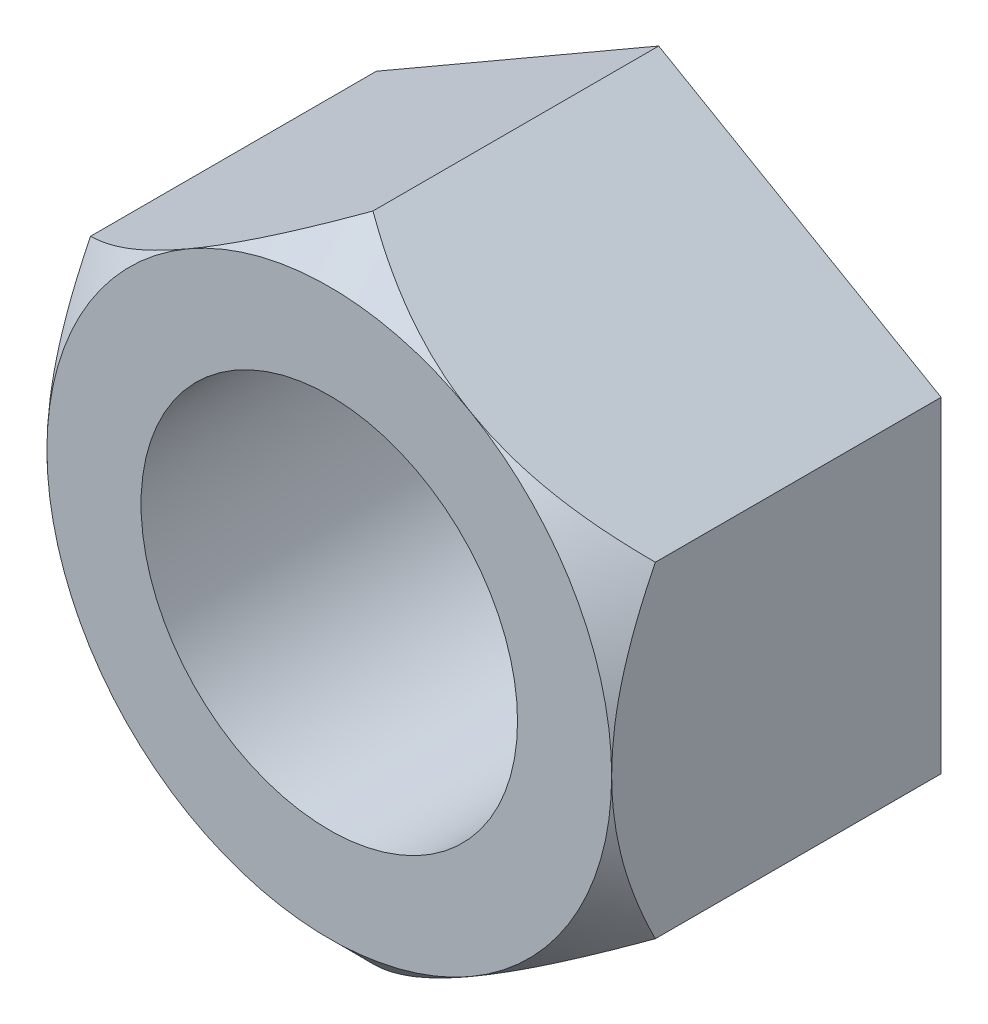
ISO-10303-21;
HEADER;
FILE_DESCRIPTION(('STEP AP214'),'2;1');
FILE_NAME('part.step','',(''),(''),'','','');
FILE_SCHEMA(('AUTOMOTIVE_DESIGN { 1 0 10303 214 1 1 1 1 }'));
ENDSEC;
DATA;
#1=APPLICATION_CONTEXT('core data for automotive mechanical design processes');
#2=APPLICATION_PROTOCOL_DEFINITION('international standard','automotive_design',2000,#1);
#3=PRODUCT_CONTEXT('',#1,'mechanical');
#4=PRODUCT('Part','Part','',(#3));
#5=PRODUCT_RELATED_PRODUCT_CATEGORY('part','',(#4));
#6=PRODUCT_DEFINITION_FORMATION('','',#4);
#7=PRODUCT_DEFINITION_CONTEXT('part definition',#1,'design');
#8=PRODUCT_DEFINITION('design','',#6,#7);
#9=PRODUCT_DEFINITION_SHAPE('','',#8);
#10=(LENGTH_UNIT() NAMED_UNIT(*) SI_UNIT(.MILLI.,.METRE.));
#11=(NAMED_UNIT(*) PLANE_ANGLE_UNIT() SI_UNIT($,.RADIAN.));
#12=(NAMED_UNIT(*) SI_UNIT($,.STERADIAN.) SOLID_ANGLE_UNIT());
#13=UNCERTAINTY_MEASURE_WITH_UNIT(LENGTH_MEASURE(1.E-05),#10,'distance_accuracy_value','');
#14=(GEOMETRIC_REPRESENTATION_CONTEXT(3) GLOBAL_UNCERTAINTY_ASSIGNED_CONTEXT((#13)) GLOBAL_UNIT_ASSIGNED_CONTEXT((#10,
#11,#12)) REPRESENTATION_CONTEXT('',''));
#15=CARTESIAN_POINT('',(0.,0.,0.));
#16=DIRECTION('',(0.,0.,1.));
#17=DIRECTION('',(1.,0.,0.));
#18=AXIS2_PLACEMENT_3D('',#15,#16,#17);
#19=CARTESIAN_POINT('',(0.,10.9985226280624,11.1125));
#20=DIRECTION('',(0.,0.,1.));
#21=DIRECTION('',(1.,0.,0.));
#22=AXIS2_PLACEMENT_3D('',#19,#20,#21);
#23=PLANE('',#22);
#24=CARTESIAN_POINT('',(0.,0.,11.1125));
#25=DIRECTION('',(0.,0.,1.));
#26=DIRECTION('',(1.,0.,0.));
#27=AXIS2_PLACEMENT_3D('',#24,#25,#26);
#28=CIRCLE('',#27,9.525);
#29=CARTESIAN_POINT('',(4.76250000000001,-8.24889197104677,11.1125));
#30=VERTEX_POINT('',#29);
#31=CARTESIAN_POINT('',(9.525,0.,11.1125));
#32=VERTEX_POINT('',#31);
#33=EDGE_CURVE('E136',#30,#32,#28,.T.);
#34=ORIENTED_EDGE('',*,*,#33,.T.);
#35=CARTESIAN_POINT('',(4.7625,8.24889197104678,11.1125));
#36=VERTEX_POINT('',#35);
#37=EDGE_CURVE('E119',#32,#36,#28,.T.);
#38=ORIENTED_EDGE('',*,*,#37,.T.);
#39=CARTESIAN_POINT('',(-4.7625,8.24889197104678,11.1125));
#40=VERTEX_POINT('',#39);
#41=EDGE_CURVE('E110',#36,#40,#28,.T.);
#42=ORIENTED_EDGE('',*,*,#41,.T.);
#43=CARTESIAN_POINT('',(-9.525,0.,11.1125));
#44=VERTEX_POINT('',#43);
#45=EDGE_CURVE('E120',#40,#44,#28,.T.);
#46=ORIENTED_EDGE('',*,*,#45,.T.);
#47=CARTESIAN_POINT('',(-4.76249999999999,-8.24889197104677,11.1125));
#48=VERTEX_POINT('',#47);
#49=EDGE_CURVE('E53',#44,#48,#28,.T.);
#50=ORIENTED_EDGE('',*,*,#49,.T.);
#51=EDGE_CURVE('E61',#48,#30,#28,.T.);
#52=ORIENTED_EDGE('',*,*,#51,.T.);
#53=EDGE_LOOP('',(#34,#38,#42,#46,#50,#52));
#54=FACE_BOUND('',#53,.T.);
#55=CARTESIAN_POINT('',(0.,0.,11.1125));
#56=DIRECTION('',(0.,0.,1.));
#57=DIRECTION('',(1.,0.,0.));
#58=AXIS2_PLACEMENT_3D('',#55,#56,#57);
#59=CIRCLE('',#58,6.35);
#60=CARTESIAN_POINT('',(6.35,0.,11.1125));
#61=VERTEX_POINT('',#60);
#62=EDGE_CURVE('E236',#61,#61,#59,.T.);
#63=ORIENTED_EDGE('',*,*,#62,.F.);
#64=EDGE_LOOP('',(#63));
#65=FACE_BOUND('',#64,.T.);
#66=ADVANCED_FACE('F32',(#54,#65),#23,.T.);
#67=CARTESIAN_POINT('',(0.,10.9985226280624,0.));
#68=DIRECTION('',(0.,0.,1.));
#69=DIRECTION('',(1.,0.,0.));
#70=AXIS2_PLACEMENT_3D('',#67,#68,#69);
#71=PLANE('',#70);
#72=DIRECTION('',(-0.866025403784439,-0.5,0.));
#73=VECTOR('',#72,1.);
#74=CARTESIAN_POINT('',(0.,10.9985226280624,0.));
#75=LINE('',#74,#73);
#76=CARTESIAN_POINT('',(0.,10.9985226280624,0.));
#77=VERTEX_POINT('',#76);
#78=CARTESIAN_POINT('',(-9.525,5.49926131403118,0.));
#79=VERTEX_POINT('',#78);
#80=EDGE_CURVE('E231',#77,#79,#75,.T.);
#81=ORIENTED_EDGE('',*,*,#80,.F.);
#82=DIRECTION('',(0.866025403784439,-0.5,0.));
#83=VECTOR('',#82,1.);
#84=CARTESIAN_POINT('',(0.,10.9985226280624,0.));
#85=LINE('',#84,#83);
#86=CARTESIAN_POINT('',(9.525,5.49926131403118,0.));
#87=VERTEX_POINT('',#86);
#88=EDGE_CURVE('E217',#77,#87,#85,.T.);
#89=ORIENTED_EDGE('',*,*,#88,.T.);
#90=DIRECTION('',(0.,-1.,0.));
#91=VECTOR('',#90,1.);
#92=CARTESIAN_POINT('',(9.525,5.49926131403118,0.));
#93=LINE('',#92,#91);
#94=CARTESIAN_POINT('',(9.525,-5.49926131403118,0.));
#95=VERTEX_POINT('',#94);
#96=EDGE_CURVE('E212',#87,#95,#93,.T.);
#97=ORIENTED_EDGE('',*,*,#96,.T.);
#98=DIRECTION('',(0.866025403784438,0.500000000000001,0.));
#99=VECTOR('',#98,1.);
#100=CARTESIAN_POINT('',(0.,-10.9985226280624,0.));
#101=LINE('',#100,#99);
#102=CARTESIAN_POINT('',(0.,-10.9985226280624,0.));
#103=VERTEX_POINT('',#102);
#104=EDGE_CURVE('E241',#103,#95,#101,.T.);
#105=ORIENTED_EDGE('',*,*,#104,.F.);
#106=DIRECTION('',(-0.866025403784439,0.5,0.));
#107=VECTOR('',#106,1.);
#108=CARTESIAN_POINT('',(0.,-10.9985226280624,0.));
#109=LINE('',#108,#107);
#110=CARTESIAN_POINT('',(-9.525,-5.49926131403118,0.));
#111=VERTEX_POINT('',#110);
#112=EDGE_CURVE('E234',#103,#111,#109,.T.);
#113=ORIENTED_EDGE('',*,*,#112,.T.);
#114=DIRECTION('',(0.,-1.,0.));
#115=VECTOR('',#114,1.);
#116=CARTESIAN_POINT('',(-9.525,5.49926131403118,0.));
#117=LINE('',#116,#115);
#118=EDGE_CURVE('E223',#79,#111,#117,.T.);
#119=ORIENTED_EDGE('',*,*,#118,.F.);
#120=EDGE_LOOP('',(#81,#89,#97,#105,#113,#119));
#121=FACE_BOUND('',#120,.T.);
#122=CARTESIAN_POINT('',(0.,0.,0.));
#123=DIRECTION('',(0.,0.,1.));
#124=DIRECTION('',(1.,0.,0.));
#125=AXIS2_PLACEMENT_3D('',#122,#123,#124);
#126=CIRCLE('',#125,6.35);
#127=CARTESIAN_POINT('',(6.35,0.,0.));
#128=VERTEX_POINT('',#127);
#129=EDGE_CURVE('E147',#128,#128,#126,.T.);
#130=ORIENTED_EDGE('',*,*,#129,.T.);
#131=EDGE_LOOP('',(#130));
#132=FACE_BOUND('',#131,.T.);
#133=ADVANCED_FACE('F229',(#121,#132),#71,.F.);
#134=CARTESIAN_POINT('',(0.,10.9985226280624,11.1125));
#135=DIRECTION('',(0.5,-0.866025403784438,0.));
#136=DIRECTION('',(0.866025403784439,0.5,0.));
#137=AXIS2_PLACEMENT_3D('',#134,#135,#136);
#138=PLANE('',#137);
#139=CARTESIAN_POINT('',(0.000200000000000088,10.9986380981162,9.63886190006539));
#140=CARTESIAN_POINT('',(-0.163556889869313,10.9040930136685,9.73339363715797));
#141=CARTESIAN_POINT('',(-0.328596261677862,10.808807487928,9.82504079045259));
#142=CARTESIAN_POINT('',(-0.661439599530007,10.616640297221,10.001649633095));
#143=CARTESIAN_POINT('',(-0.829245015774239,10.519757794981,10.0866076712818));
#144=CARTESIAN_POINT('',(-1.16861155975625,10.323824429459,10.2492817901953));
#145=CARTESIAN_POINT('',(-1.34018869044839,10.2247643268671,10.3269536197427));
#146=CARTESIAN_POINT('',(-1.6861610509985,10.0250170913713,10.4733683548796));
#147=CARTESIAN_POINT('',(-1.8605558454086,9.92433020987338,10.5421126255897));
#148=CARTESIAN_POINT('',(-2.20935953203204,9.72294830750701,10.668497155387));
#149=CARTESIAN_POINT('',(-2.38372555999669,9.62227803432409,10.7262942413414));
#150=CARTESIAN_POINT('',(-2.73490192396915,9.41952626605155,10.8309305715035));
#151=CARTESIAN_POINT('',(-2.91171199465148,9.31744492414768,10.8777709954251));
#152=CARTESIAN_POINT('',(-3.26702017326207,9.11230765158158,10.9593147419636));
#153=CARTESIAN_POINT('',(-3.44551353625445,9.00925446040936,10.994045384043));
#154=CARTESIAN_POINT('',(-3.80399877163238,8.80228291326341,11.0506064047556));
#155=CARTESIAN_POINT('',(-3.98399041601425,8.69836468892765,11.0724387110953));
#156=CARTESIAN_POINT('',(-4.42261424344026,8.44512510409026,11.1090452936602));
#157=CARTESIAN_POINT('',(-4.68172051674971,8.29553002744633,11.1167271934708));
#158=CARTESIAN_POINT('',(-5.19946445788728,7.99661042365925,11.1038335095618));
#159=CARTESIAN_POINT('',(-5.45810192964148,7.84728600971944,11.0832480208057));
#160=CARTESIAN_POINT('',(-5.97293882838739,7.55004478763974,11.0150346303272));
#161=CARTESIAN_POINT('',(-6.22913520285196,7.40212974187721,10.9673764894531));
#162=CARTESIAN_POINT('',(-6.73712442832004,7.10884202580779,10.8476083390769));
#163=CARTESIAN_POINT('',(-6.98891761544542,6.96346916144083,10.775500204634));
#164=CARTESIAN_POINT('',(-7.4358847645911,6.70541255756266,10.6271554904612));
#165=CARTESIAN_POINT('',(-7.63204865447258,6.5921572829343,10.5548211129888));
#166=CARTESIAN_POINT('',(-8.02085525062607,6.36767968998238,10.3984965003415));
#167=CARTESIAN_POINT('',(-8.21349785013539,6.25645743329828,10.3145059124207));
#168=CARTESIAN_POINT('',(-8.59465509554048,6.03639619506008,10.1367514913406));
#169=CARTESIAN_POINT('',(-8.78318058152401,5.92755095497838,10.0430183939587));
#170=CARTESIAN_POINT('',(-9.15674078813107,5.71187586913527,9.84700942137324));
#171=CARTESIAN_POINT('',(-9.34177756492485,5.6050448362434,9.74473878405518));
#172=CARTESIAN_POINT('',(-9.5252,5.49914584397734,9.63886190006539));
#173=B_SPLINE_CURVE_WITH_KNOTS('',3,(#139,#140,#141,#142,#143,#144,#145,#146,#147,#148,#149,
#150,#151,#152,#153,#154,#155,#156,#157,#158,#159,#160,#161,#162,#163,#164,#165,#166,#167,#168,
#169,#170,#171,#172),.UNSPECIFIED.,.F.,.F.,(4,2,2,2,2,2,2,2,2,2,2,2,2,2,2,2,4),(0.,
0.63423665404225,1.2688171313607,1.90703107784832,2.5451473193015,3.17328515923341,
3.80135533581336,4.42799928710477,5.05454956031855,5.95101645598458,6.84779755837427,
7.74558230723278,8.64329822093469,9.35630333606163,10.0693300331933,10.7801718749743,
11.4905807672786),.UNSPECIFIED.);
#174=CARTESIAN_POINT('',(0.,10.9985226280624,9.63897737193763));
#175=VERTEX_POINT('',#174);
#176=EDGE_CURVE('E114',#175,#40,#173,.T.);
#177=ORIENTED_EDGE('',*,*,#176,.F.);
#178=DIRECTION('',(0.,0.,-1.));
#179=VECTOR('',#178,1.);
#180=CARTESIAN_POINT('',(0.,10.9985226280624,11.1125));
#181=LINE('',#180,#179);
#182=EDGE_CURVE('E134',#175,#77,#181,.T.);
#183=ORIENTED_EDGE('',*,*,#182,.T.);
#184=ORIENTED_EDGE('',*,*,#80,.T.);
#185=DIRECTION('',(0.,0.,-1.));
#186=VECTOR('',#185,1.);
#187=CARTESIAN_POINT('',(-9.525,5.49926131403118,11.1125));
#188=LINE('',#187,#186);
#189=CARTESIAN_POINT('',(-9.525,5.49926131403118,9.63897737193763));
#190=VERTEX_POINT('',#189);
#191=EDGE_CURVE('E130',#190,#79,#188,.T.);
#192=ORIENTED_EDGE('',*,*,#191,.F.);
#193=EDGE_CURVE('E141',#40,#190,#173,.T.);
#194=ORIENTED_EDGE('',*,*,#193,.F.);
#195=EDGE_LOOP('',(#177,#183,#184,#192,#194));
#196=FACE_BOUND('',#195,.T.);
#197=ADVANCED_FACE('F34',(#196),#138,.F.);
#198=CARTESIAN_POINT('',(-9.525,5.49926131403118,11.1125));
#199=DIRECTION('',(1.,0.,0.));
#200=DIRECTION('',(0.,0.,-1.));
#201=AXIS2_PLACEMENT_3D('',#198,#199,#200);
#202=PLANE('',#201);
#203=CARTESIAN_POINT('',(-9.525,-13.6475546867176,3.99474259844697));
#204=CARTESIAN_POINT('',(-9.525,-13.4757768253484,4.13560293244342));
#205=CARTESIAN_POINT('',(-9.525,-13.30357472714,4.27594566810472));
#206=CARTESIAN_POINT('',(-9.525,-12.9582376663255,4.5554834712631));
#207=CARTESIAN_POINT('',(-9.525,-12.7851026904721,4.6946785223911));
#208=CARTESIAN_POINT('',(-9.525,-12.2640952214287,5.11043446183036));
#209=CARTESIAN_POINT('',(-9.525,-11.9147031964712,5.38509789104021));
#210=CARTESIAN_POINT('',(-9.525,-11.207225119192,5.93116277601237));
#211=CARTESIAN_POINT('',(-9.525,-10.8490857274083,6.20249528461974));
#212=CARTESIAN_POINT('',(-9.525,-10.1268899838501,6.73711946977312));
#213=CARTESIAN_POINT('',(-9.525,-9.76283420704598,7.00041192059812));
#214=CARTESIAN_POINT('',(-9.525,-8.99326316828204,7.54084403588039));
#215=CARTESIAN_POINT('',(-9.525,-8.5870451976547,7.81698852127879));
#216=CARTESIAN_POINT('',(-9.525,-7.76382921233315,8.35315947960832));
#217=CARTESIAN_POINT('',(-9.525,-7.34682774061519,8.61318069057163));
#218=CARTESIAN_POINT('',(-9.525,-6.50174237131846,9.11005944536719));
#219=CARTESIAN_POINT('',(-9.525,-6.07371876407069,9.34701871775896));
#220=CARTESIAN_POINT('',(-9.525,-5.20241731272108,9.7908237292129));
#221=CARTESIAN_POINT('',(-9.525,-4.75915306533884,9.99769549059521));
#222=CARTESIAN_POINT('',(-9.525,-4.14630196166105,10.2502000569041));
#223=CARTESIAN_POINT('',(-9.525,-3.98412748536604,10.3139362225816));
#224=CARTESIAN_POINT('',(-9.525,-3.65758699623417,10.4355114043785));
#225=CARTESIAN_POINT('',(-9.525,-3.49322100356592,10.4933504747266));
#226=CARTESIAN_POINT('',(-9.525,-2.99679901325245,10.6570738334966));
#227=CARTESIAN_POINT('',(-9.525,-2.66141205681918,10.753167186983));
#228=CARTESIAN_POINT('',(-9.525,-1.99060566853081,10.912046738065));
#229=CARTESIAN_POINT('',(-9.525,-1.65535233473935,10.9755251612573));
#230=CARTESIAN_POINT('',(-9.525,-0.980087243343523,11.0680411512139));
#231=CARTESIAN_POINT('',(-9.525,-0.640076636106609,11.0970869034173));
#232=CARTESIAN_POINT('',(-9.525,0.0234491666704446,11.1179439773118));
#233=CARTESIAN_POINT('',(-9.525,0.346906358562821,11.1116063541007));
#234=CARTESIAN_POINT('',(-9.525,0.991523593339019,11.0664332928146));
#235=CARTESIAN_POINT('',(-9.525,1.31268347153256,11.0275955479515));
#236=CARTESIAN_POINT('',(-9.525,1.95598795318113,10.919014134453));
#237=CARTESIAN_POINT('',(-9.525,2.2780330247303,10.8486912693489));
#238=CARTESIAN_POINT('',(-9.525,2.91493490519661,10.6811975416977));
#239=CARTESIAN_POINT('',(-9.525,3.22979185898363,10.5840272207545));
#240=CARTESIAN_POINT('',(-9.525,3.85988281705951,10.3644894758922));
#241=CARTESIAN_POINT('',(-9.525,4.17490496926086,10.2415216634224));
#242=CARTESIAN_POINT('',(-9.525,4.79689429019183,9.97651554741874));
#243=CARTESIAN_POINT('',(-9.525,5.10385785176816,9.83446887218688));
#244=CARTESIAN_POINT('',(-9.525,5.71114292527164,9.53467024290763));
#245=CARTESIAN_POINT('',(-9.525,6.01144079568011,9.37687079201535));
#246=CARTESIAN_POINT('',(-9.525,6.60517377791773,9.04902718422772));
#247=CARTESIAN_POINT('',(-9.525,6.89860991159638,8.87898486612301));
#248=CARTESIAN_POINT('',(-9.525,7.46514586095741,8.53768647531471));
#249=CARTESIAN_POINT('',(-9.525,7.73853380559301,8.36690614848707));
#250=CARTESIAN_POINT('',(-9.525,8.28061203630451,8.0180248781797));
#251=CARTESIAN_POINT('',(-9.525,8.54930197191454,7.83992339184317));
#252=CARTESIAN_POINT('',(-9.525,9.08045531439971,7.47913623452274));
#253=CARTESIAN_POINT('',(-9.525,9.34295124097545,7.29649826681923));
#254=CARTESIAN_POINT('',(-9.525,9.86433467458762,6.9262868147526));
#255=CARTESIAN_POINT('',(-9.525,10.1232231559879,6.73871470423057));
#256=CARTESIAN_POINT('',(-9.525,10.3805966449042,6.54912139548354));
#257=B_SPLINE_CURVE_WITH_KNOTS('',3,(#203,#204,#205,#206,#207,#208,#209,#210,#211,#212,#213,
#214,#215,#216,#217,#218,#219,#220,#221,#222,#223,#224,#225,#226,#227,#228,#229,#230,#231,#232,
#233,#234,#235,#236,#237,#238,#239,#240,#241,#242,#243,#244,#245,#246,#247,#248,#249,#250,#251,
#252,#253,#254,#255,#256),.UNSPECIFIED.,.F.,.F.,(4,2,2,2,2,2,2,2,2,2,2,2,2,2,2,2,2,2,2,2,2,2,2,
2,2,2,4),(0.,0.666439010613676,1.33288751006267,2.66610686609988,4.01396743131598,
5.36169778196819,6.83498754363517,8.30875562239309,9.77569626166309,11.241360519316,
11.7640106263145,12.2866559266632,13.3319239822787,14.3539811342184,15.3757952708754,
16.3446720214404,17.3136175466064,18.3011707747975,19.2887040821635,20.3024515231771,
21.3166452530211,22.3339949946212,23.3511922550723,24.3180935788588,25.2850667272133,
26.2443521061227,27.2033731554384),.UNSPECIFIED.);
#258=EDGE_CURVE('E143',#190,#44,#257,.F.);
#259=ORIENTED_EDGE('',*,*,#258,.F.);
#260=ORIENTED_EDGE('',*,*,#191,.T.);
#261=ORIENTED_EDGE('',*,*,#118,.T.);
#262=DIRECTION('',(0.,0.,-1.));
#263=VECTOR('',#262,1.);
#264=CARTESIAN_POINT('',(-9.525,-5.49926131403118,11.1125));
#265=LINE('',#264,#263);
#266=CARTESIAN_POINT('',(-9.525,-5.49926131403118,9.63897737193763));
#267=VERTEX_POINT('',#266);
#268=EDGE_CURVE('E153',#267,#111,#265,.T.);
#269=ORIENTED_EDGE('',*,*,#268,.F.);
#270=EDGE_CURVE('E148',#44,#267,#257,.F.);
#271=ORIENTED_EDGE('',*,*,#270,.F.);
#272=EDGE_LOOP('',(#259,#260,#261,#269,#271));
#273=FACE_BOUND('',#272,.T.);
#274=ADVANCED_FACE('F151',(#273),#202,.F.);
#275=CARTESIAN_POINT('',(0.,-10.9985226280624,11.1125));
#276=DIRECTION('',(-0.5,-0.866025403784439,0.));
#277=DIRECTION('',(0.866025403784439,-0.5,0.));
#278=AXIS2_PLACEMENT_3D('',#275,#276,#277);
#279=PLANE('',#278);
#280=DIRECTION('',(0.,0.,-1.));
#281=VECTOR('',#280,1.);
#282=CARTESIAN_POINT('',(0.,-10.9985226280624,11.1125));
#283=LINE('',#282,#281);
#284=CARTESIAN_POINT('',(0.,-10.9985226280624,9.63897737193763));
#285=VERTEX_POINT('',#284);
#286=EDGE_CURVE('E215',#285,#103,#283,.T.);
#287=ORIENTED_EDGE('',*,*,#286,.F.);
#288=CARTESIAN_POINT('',(0.000200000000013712,-10.9986380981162,9.63886190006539));
#289=CARTESIAN_POINT('',(-0.163556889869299,-10.9040930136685,9.73339363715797));
#290=CARTESIAN_POINT('',(-0.328596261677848,-10.808807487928,9.82504079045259));
#291=CARTESIAN_POINT('',(-0.661439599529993,-10.616640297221,10.001649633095));
#292=CARTESIAN_POINT('',(-0.829245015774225,-10.519757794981,10.0866076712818));
#293=CARTESIAN_POINT('',(-1.16861155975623,-10.323824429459,10.2492817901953));
#294=CARTESIAN_POINT('',(-1.34018869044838,-10.2247643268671,10.3269536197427));
#295=CARTESIAN_POINT('',(-1.68616105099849,-10.0250170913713,10.4733683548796));
#296=CARTESIAN_POINT('',(-1.86055584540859,-9.92433020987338,10.5421126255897));
#297=CARTESIAN_POINT('',(-2.20935953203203,-9.72294830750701,10.668497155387));
#298=CARTESIAN_POINT('',(-2.38372555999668,-9.62227803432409,10.7262942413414));
#299=CARTESIAN_POINT('',(-2.73490192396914,-9.41952626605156,10.8309305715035));
#300=CARTESIAN_POINT('',(-2.91171199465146,-9.31744492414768,10.8777709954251));
#301=CARTESIAN_POINT('',(-3.26702017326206,-9.11230765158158,10.9593147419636));
#302=CARTESIAN_POINT('',(-3.44551353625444,-9.00925446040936,10.994045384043));
#303=CARTESIAN_POINT('',(-3.80399877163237,-8.80228291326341,11.0506064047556));
#304=CARTESIAN_POINT('',(-3.98399041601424,-8.69836468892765,11.0724387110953));
#305=CARTESIAN_POINT('',(-4.42261424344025,-8.44512510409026,11.1090452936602));
#306=CARTESIAN_POINT('',(-4.6817205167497,-8.29553002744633,11.1167271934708));
#307=CARTESIAN_POINT('',(-5.19946445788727,-7.99661042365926,11.1038335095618));
#308=CARTESIAN_POINT('',(-5.45810192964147,-7.84728600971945,11.0832480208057));
#309=CARTESIAN_POINT('',(-5.97293882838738,-7.55004478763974,11.0150346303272));
#310=CARTESIAN_POINT('',(-6.22913520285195,-7.40212974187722,10.9673764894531));
#311=CARTESIAN_POINT('',(-6.73712442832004,-7.10884202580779,10.8476083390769));
#312=CARTESIAN_POINT('',(-6.98891761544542,-6.96346916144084,10.775500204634));
#313=CARTESIAN_POINT('',(-7.4358847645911,-6.70541255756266,10.6271554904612));
#314=CARTESIAN_POINT('',(-7.63204865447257,-6.59215728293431,10.5548211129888));
#315=CARTESIAN_POINT('',(-8.02085525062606,-6.36767968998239,10.3984965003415));
#316=CARTESIAN_POINT('',(-8.21349785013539,-6.25645743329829,10.3145059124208));
#317=CARTESIAN_POINT('',(-8.59465509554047,-6.03639619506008,10.1367514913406));
#318=CARTESIAN_POINT('',(-8.78318058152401,-5.92755095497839,10.0430183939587));
#319=CARTESIAN_POINT('',(-9.15674078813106,-5.71187586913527,9.84700942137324));
#320=CARTESIAN_POINT('',(-9.34177756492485,-5.6050448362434,9.74473878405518));
#321=CARTESIAN_POINT('',(-9.5252,-5.49914584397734,9.63886190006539));
#322=B_SPLINE_CURVE_WITH_KNOTS('',3,(#288,#289,#290,#291,#292,#293,#294,#295,#296,#297,#298,
#299,#300,#301,#302,#303,#304,#305,#306,#307,#308,#309,#310,#311,#312,#313,#314,#315,#316,#317,
#318,#319,#320,#321),.UNSPECIFIED.,.F.,.F.,(4,2,2,2,2,2,2,2,2,2,2,2,2,2,2,2,4),(0.,
0.634236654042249,1.26881713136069,1.90703107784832,2.5451473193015,3.17328515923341,
3.80135533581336,4.42799928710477,5.05454956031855,5.95101645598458,6.84779755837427,
7.74558230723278,8.64329822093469,9.35630333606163,10.0693300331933,10.7801718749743,
11.4905807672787),.UNSPECIFIED.);
#323=EDGE_CURVE('E157',#285,#48,#322,.T.);
#324=ORIENTED_EDGE('',*,*,#323,.T.);
#325=EDGE_CURVE('E155',#48,#267,#322,.T.);
#326=ORIENTED_EDGE('',*,*,#325,.T.);
#327=ORIENTED_EDGE('',*,*,#268,.T.);
#328=ORIENTED_EDGE('',*,*,#112,.F.);
#329=EDGE_LOOP('',(#287,#324,#326,#327,#328));
#330=FACE_BOUND('',#329,.T.);
#331=ADVANCED_FACE('F172',(#330),#279,.T.);
#332=CARTESIAN_POINT('',(0.,-10.9985226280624,11.1125));
#333=DIRECTION('',(-0.500000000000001,0.866025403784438,0.));
#334=DIRECTION('',(-0.866025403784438,-0.500000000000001,0.));
#335=AXIS2_PLACEMENT_3D('',#332,#333,#334);
#336=PLANE('',#335);
#337=CARTESIAN_POINT('',(-0.000199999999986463,-10.9986380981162,9.63886190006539));
#338=CARTESIAN_POINT('',(0.163556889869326,-10.9040930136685,9.73339363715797));
#339=CARTESIAN_POINT('',(0.328596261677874,-10.808807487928,9.82504079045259));
#340=CARTESIAN_POINT('',(0.661439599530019,-10.616640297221,10.001649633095));
#341=CARTESIAN_POINT('',(0.829245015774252,-10.519757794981,10.0866076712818));
#342=CARTESIAN_POINT('',(1.16861155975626,-10.323824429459,10.2492817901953));
#343=CARTESIAN_POINT('',(1.34018869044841,-10.2247643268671,10.3269536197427));
#344=CARTESIAN_POINT('',(1.68616105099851,-10.0250170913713,10.4733683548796));
#345=CARTESIAN_POINT('',(1.86055584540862,-9.92433020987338,10.5421126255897));
#346=CARTESIAN_POINT('',(2.20935953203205,-9.722948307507,10.668497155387));
#347=CARTESIAN_POINT('',(2.3837255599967,-9.62227803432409,10.7262942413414));
#348=CARTESIAN_POINT('',(2.73490192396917,-9.41952626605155,10.8309305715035));
#349=CARTESIAN_POINT('',(2.91171199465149,-9.31744492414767,10.8777709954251));
#350=CARTESIAN_POINT('',(3.26702017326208,-9.11230765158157,10.9593147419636));
#351=CARTESIAN_POINT('',(3.44551353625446,-9.00925446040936,10.994045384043));
#352=CARTESIAN_POINT('',(3.80399877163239,-8.80228291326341,11.0506064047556));
#353=CARTESIAN_POINT('',(3.98399041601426,-8.69836468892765,11.0724387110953));
#354=CARTESIAN_POINT('',(4.42261424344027,-8.44512510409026,11.1090452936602));
#355=CARTESIAN_POINT('',(4.68172051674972,-8.29553002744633,11.1167271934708));
#356=CARTESIAN_POINT('',(5.19946445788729,-7.99661042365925,11.1038335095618));
#357=CARTESIAN_POINT('',(5.45810192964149,-7.84728600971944,11.0832480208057));
#358=CARTESIAN_POINT('',(5.9729388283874,-7.55004478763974,11.0150346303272));
#359=CARTESIAN_POINT('',(6.22913520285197,-7.40212974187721,10.9673764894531));
#360=CARTESIAN_POINT('',(6.73712442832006,-7.10884202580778,10.8476083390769));
#361=CARTESIAN_POINT('',(6.98891761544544,-6.96346916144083,10.775500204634));
#362=CARTESIAN_POINT('',(7.43588476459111,-6.70541255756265,10.6271554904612));
#363=CARTESIAN_POINT('',(7.63204865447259,-6.5921572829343,10.5548211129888));
#364=CARTESIAN_POINT('',(8.02085525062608,-6.36767968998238,10.3984965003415));
#365=CARTESIAN_POINT('',(8.2134978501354,-6.25645743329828,10.3145059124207));
#366=CARTESIAN_POINT('',(8.59465509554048,-6.03639619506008,10.1367514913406));
#367=CARTESIAN_POINT('',(8.78318058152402,-5.92755095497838,10.0430183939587));
#368=CARTESIAN_POINT('',(9.15674078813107,-5.71187586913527,9.84700942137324));
#369=CARTESIAN_POINT('',(9.34177756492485,-5.6050448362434,9.74473878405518));
#370=CARTESIAN_POINT('',(9.5252,-5.49914584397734,9.63886190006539));
#371=B_SPLINE_CURVE_WITH_KNOTS('',3,(#337,#338,#339,#340,#341,#342,#343,#344,#345,#346,#347,
#348,#349,#350,#351,#352,#353,#354,#355,#356,#357,#358,#359,#360,#361,#362,#363,#364,#365,#366,
#367,#368,#369,#370),.UNSPECIFIED.,.F.,.F.,(4,2,2,2,2,2,2,2,2,2,2,2,2,2,2,2,4),(0.,
0.634236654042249,1.26881713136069,1.90703107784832,2.5451473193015,3.17328515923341,
3.80135533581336,4.42799928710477,5.05454956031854,5.95101645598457,6.84779755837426,
7.74558230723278,8.64329822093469,9.35630333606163,10.0693300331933,10.7801718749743,
11.4905807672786),.UNSPECIFIED.);
#372=EDGE_CURVE('E189',#285,#30,#371,.T.);
#373=ORIENTED_EDGE('',*,*,#372,.F.);
#374=ORIENTED_EDGE('',*,*,#286,.T.);
#375=ORIENTED_EDGE('',*,*,#104,.T.);
#376=DIRECTION('',(0.,0.,-1.));
#377=VECTOR('',#376,1.);
#378=CARTESIAN_POINT('',(9.525,-5.49926131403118,11.1125));
#379=LINE('',#378,#377);
#380=CARTESIAN_POINT('',(9.525,-5.49926131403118,9.63897737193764));
#381=VERTEX_POINT('',#380);
#382=EDGE_CURVE('E204',#381,#95,#379,.T.);
#383=ORIENTED_EDGE('',*,*,#382,.F.);
#384=EDGE_CURVE('E184',#30,#381,#371,.T.);
#385=ORIENTED_EDGE('',*,*,#384,.F.);
#386=EDGE_LOOP('',(#373,#374,#375,#383,#385));
#387=FACE_BOUND('',#386,.T.);
#388=ADVANCED_FACE('F176',(#387),#336,.F.);
#389=CARTESIAN_POINT('',(9.525,5.49926131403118,11.1125));
#390=DIRECTION('',(1.,0.,0.));
#391=DIRECTION('',(0.,0.,-1.));
#392=AXIS2_PLACEMENT_3D('',#389,#390,#391);
#393=PLANE('',#392);
#394=DIRECTION('',(0.,0.,-1.));
#395=VECTOR('',#394,1.);
#396=CARTESIAN_POINT('',(9.525,5.49926131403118,11.1125));
#397=LINE('',#396,#395);
#398=CARTESIAN_POINT('',(9.525,5.49926131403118,9.63897737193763));
#399=VERTEX_POINT('',#398);
#400=EDGE_CURVE('E210',#399,#87,#397,.T.);
#401=ORIENTED_EDGE('',*,*,#400,.F.);
#402=CARTESIAN_POINT('',(9.525,-13.6475546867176,3.99474259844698));
#403=CARTESIAN_POINT('',(9.525,-13.4757768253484,4.13560293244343));
#404=CARTESIAN_POINT('',(9.525,-13.30357472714,4.27594566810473));
#405=CARTESIAN_POINT('',(9.525,-12.9582376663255,4.55548347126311));
#406=CARTESIAN_POINT('',(9.525,-12.7851026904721,4.69467852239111));
#407=CARTESIAN_POINT('',(9.525,-12.2640952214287,5.11043446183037));
#408=CARTESIAN_POINT('',(9.525,-11.9147031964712,5.38509789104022));
#409=CARTESIAN_POINT('',(9.525,-11.207225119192,5.93116277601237));
#410=CARTESIAN_POINT('',(9.525,-10.8490857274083,6.20249528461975));
#411=CARTESIAN_POINT('',(9.525,-10.1268899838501,6.73711946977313));
#412=CARTESIAN_POINT('',(9.525,-9.76283420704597,7.00041192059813));
#413=CARTESIAN_POINT('',(9.525,-8.99326316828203,7.54084403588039));
#414=CARTESIAN_POINT('',(9.525,-8.58704519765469,7.81698852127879));
#415=CARTESIAN_POINT('',(9.525,-7.76382921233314,8.35315947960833));
#416=CARTESIAN_POINT('',(9.525,-7.34682774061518,8.61318069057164));
#417=CARTESIAN_POINT('',(9.525,-6.50174237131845,9.11005944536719));
#418=CARTESIAN_POINT('',(9.525,-6.07371876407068,9.34701871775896));
#419=CARTESIAN_POINT('',(9.525,-5.20241731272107,9.7908237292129));
#420=CARTESIAN_POINT('',(9.525,-4.75915306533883,9.99769549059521));
#421=CARTESIAN_POINT('',(9.525,-4.14630196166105,10.2502000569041));
#422=CARTESIAN_POINT('',(9.525,-3.98412748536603,10.3139362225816));
#423=CARTESIAN_POINT('',(9.525,-3.65758699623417,10.4355114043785));
#424=CARTESIAN_POINT('',(9.525,-3.49322100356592,10.4933504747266));
#425=CARTESIAN_POINT('',(9.525,-2.99679901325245,10.6570738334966));
#426=CARTESIAN_POINT('',(9.525,-2.66141205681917,10.753167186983));
#427=CARTESIAN_POINT('',(9.525,-1.9906056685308,10.912046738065));
#428=CARTESIAN_POINT('',(9.525,-1.65535233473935,10.9755251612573));
#429=CARTESIAN_POINT('',(9.525,-0.980087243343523,11.0680411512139));
#430=CARTESIAN_POINT('',(9.525,-0.640076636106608,11.0970869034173));
#431=CARTESIAN_POINT('',(9.525,0.0234491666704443,11.1179439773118));
#432=CARTESIAN_POINT('',(9.525,0.346906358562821,11.1116063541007));
#433=CARTESIAN_POINT('',(9.525,0.991523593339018,11.0664332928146));
#434=CARTESIAN_POINT('',(9.525,1.31268347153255,11.0275955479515));
#435=CARTESIAN_POINT('',(9.525,1.95598795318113,10.919014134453));
#436=CARTESIAN_POINT('',(9.525,2.2780330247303,10.8486912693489));
#437=CARTESIAN_POINT('',(9.525,2.91493490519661,10.6811975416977));
#438=CARTESIAN_POINT('',(9.525,3.22979185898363,10.5840272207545));
#439=CARTESIAN_POINT('',(9.525,3.8598828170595,10.3644894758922));
#440=CARTESIAN_POINT('',(9.525,4.17490496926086,10.2415216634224));
#441=CARTESIAN_POINT('',(9.525,4.79689429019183,9.97651554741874));
#442=CARTESIAN_POINT('',(9.525,5.10385785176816,9.83446887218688));
#443=CARTESIAN_POINT('',(9.525,5.71114292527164,9.53467024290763));
#444=CARTESIAN_POINT('',(9.525,6.0114407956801,9.37687079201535));
#445=CARTESIAN_POINT('',(9.525,6.60517377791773,9.04902718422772));
#446=CARTESIAN_POINT('',(9.525,6.89860991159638,8.87898486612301));
#447=CARTESIAN_POINT('',(9.525,7.46514586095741,8.53768647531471));
#448=CARTESIAN_POINT('',(9.525,7.73853380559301,8.36690614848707));
#449=CARTESIAN_POINT('',(9.525,8.28061203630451,8.0180248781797));
#450=CARTESIAN_POINT('',(9.525,8.54930197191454,7.83992339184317));
#451=CARTESIAN_POINT('',(9.525,9.0804553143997,7.47913623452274));
#452=CARTESIAN_POINT('',(9.525,9.34295124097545,7.29649826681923));
#453=CARTESIAN_POINT('',(9.525,9.86433467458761,6.9262868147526));
#454=CARTESIAN_POINT('',(9.525,10.1232231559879,6.73871470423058));
#455=CARTESIAN_POINT('',(9.525,10.3805966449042,6.54912139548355));
#456=B_SPLINE_CURVE_WITH_KNOTS('',3,(#402,#403,#404,#405,#406,#407,#408,#409,#410,#411,#412,
#413,#414,#415,#416,#417,#418,#419,#420,#421,#422,#423,#424,#425,#426,#427,#428,#429,#430,#431,
#432,#433,#434,#435,#436,#437,#438,#439,#440,#441,#442,#443,#444,#445,#446,#447,#448,#449,#450,
#451,#452,#453,#454,#455),.UNSPECIFIED.,.F.,.F.,(4,2,2,2,2,2,2,2,2,2,2,2,2,2,2,2,2,2,2,2,2,2,2,
2,2,2,4),(0.,0.666439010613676,1.33288751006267,2.66610686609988,4.01396743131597,
5.36169778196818,6.83498754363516,8.30875562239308,9.77569626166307,11.241360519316,
11.7640106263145,12.2866559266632,13.3319239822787,14.3539811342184,15.3757952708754,
16.3446720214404,17.3136175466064,18.3011707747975,19.2887040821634,20.302451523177,
21.316645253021,22.3339949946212,23.3511922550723,24.3180935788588,25.2850667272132,
26.2443521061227,27.2033731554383),.UNSPECIFIED.);
#457=EDGE_CURVE('E127',#399,#32,#456,.F.);
#458=ORIENTED_EDGE('',*,*,#457,.T.);
#459=EDGE_CURVE('E138',#32,#381,#456,.F.);
#460=ORIENTED_EDGE('',*,*,#459,.T.);
#461=ORIENTED_EDGE('',*,*,#382,.T.);
#462=ORIENTED_EDGE('',*,*,#96,.F.);
#463=EDGE_LOOP('',(#401,#458,#460,#461,#462));
#464=FACE_BOUND('',#463,.T.);
#465=ADVANCED_FACE('F181',(#464),#393,.T.);
#466=CARTESIAN_POINT('',(0.,10.9985226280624,11.1125));
#467=DIRECTION('',(0.5,0.866025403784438,0.));
#468=DIRECTION('',(-0.866025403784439,0.5,0.));
#469=AXIS2_PLACEMENT_3D('',#466,#467,#468);
#470=PLANE('',#469);
#471=ORIENTED_EDGE('',*,*,#182,.F.);
#472=CARTESIAN_POINT('',(-0.000200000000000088,10.9986380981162,9.63886190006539));
#473=CARTESIAN_POINT('',(0.163556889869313,10.9040930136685,9.73339363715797));
#474=CARTESIAN_POINT('',(0.328596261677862,10.808807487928,9.82504079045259));
#475=CARTESIAN_POINT('',(0.661439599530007,10.616640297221,10.001649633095));
#476=CARTESIAN_POINT('',(0.829245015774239,10.519757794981,10.0866076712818));
#477=CARTESIAN_POINT('',(1.16861155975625,10.323824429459,10.2492817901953));
#478=CARTESIAN_POINT('',(1.34018869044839,10.2247643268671,10.3269536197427));
#479=CARTESIAN_POINT('',(1.6861610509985,10.0250170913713,10.4733683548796));
#480=CARTESIAN_POINT('',(1.8605558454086,9.92433020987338,10.5421126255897));
#481=CARTESIAN_POINT('',(2.20935953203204,9.72294830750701,10.668497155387));
#482=CARTESIAN_POINT('',(2.38372555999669,9.62227803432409,10.7262942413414));
#483=CARTESIAN_POINT('',(2.73490192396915,9.41952626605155,10.8309305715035));
#484=CARTESIAN_POINT('',(2.91171199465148,9.31744492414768,10.8777709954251));
#485=CARTESIAN_POINT('',(3.26702017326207,9.11230765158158,10.9593147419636));
#486=CARTESIAN_POINT('',(3.44551353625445,9.00925446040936,10.994045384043));
#487=CARTESIAN_POINT('',(3.80399877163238,8.80228291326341,11.0506064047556));
#488=CARTESIAN_POINT('',(3.98399041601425,8.69836468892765,11.0724387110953));
#489=CARTESIAN_POINT('',(4.42261424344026,8.44512510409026,11.1090452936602));
#490=CARTESIAN_POINT('',(4.68172051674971,8.29553002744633,11.1167271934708));
#491=CARTESIAN_POINT('',(5.19946445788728,7.99661042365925,11.1038335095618));
#492=CARTESIAN_POINT('',(5.45810192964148,7.84728600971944,11.0832480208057));
#493=CARTESIAN_POINT('',(5.97293882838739,7.55004478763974,11.0150346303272));
#494=CARTESIAN_POINT('',(6.22913520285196,7.40212974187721,10.9673764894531));
#495=CARTESIAN_POINT('',(6.73712442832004,7.10884202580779,10.8476083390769));
#496=CARTESIAN_POINT('',(6.98891761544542,6.96346916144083,10.775500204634));
#497=CARTESIAN_POINT('',(7.4358847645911,6.70541255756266,10.6271554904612));
#498=CARTESIAN_POINT('',(7.63204865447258,6.5921572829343,10.5548211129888));
#499=CARTESIAN_POINT('',(8.02085525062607,6.36767968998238,10.3984965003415));
#500=CARTESIAN_POINT('',(8.21349785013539,6.25645743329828,10.3145059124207));
#501=CARTESIAN_POINT('',(8.59465509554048,6.03639619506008,10.1367514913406));
#502=CARTESIAN_POINT('',(8.78318058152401,5.92755095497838,10.0430183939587));
#503=CARTESIAN_POINT('',(9.15674078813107,5.71187586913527,9.84700942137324));
#504=CARTESIAN_POINT('',(9.34177756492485,5.6050448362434,9.74473878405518));
#505=CARTESIAN_POINT('',(9.5252,5.49914584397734,9.63886190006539));
#506=B_SPLINE_CURVE_WITH_KNOTS('',3,(#472,#473,#474,#475,#476,#477,#478,#479,#480,#481,#482,
#483,#484,#485,#486,#487,#488,#489,#490,#491,#492,#493,#494,#495,#496,#497,#498,#499,#500,#501,
#502,#503,#504,#505),.UNSPECIFIED.,.F.,.F.,(4,2,2,2,2,2,2,2,2,2,2,2,2,2,2,2,4),(0.,
0.63423665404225,1.2688171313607,1.90703107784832,2.5451473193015,3.17328515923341,
3.80135533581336,4.42799928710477,5.05454956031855,5.95101645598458,6.84779755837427,
7.74558230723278,8.64329822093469,9.35630333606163,10.0693300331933,10.7801718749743,
11.4905807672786),.UNSPECIFIED.);
#507=EDGE_CURVE('E11',#175,#36,#506,.T.);
#508=ORIENTED_EDGE('',*,*,#507,.T.);
#509=EDGE_CURVE('E37',#36,#399,#506,.T.);
#510=ORIENTED_EDGE('',*,*,#509,.T.);
#511=ORIENTED_EDGE('',*,*,#400,.T.);
#512=ORIENTED_EDGE('',*,*,#88,.F.);
#513=EDGE_LOOP('',(#471,#508,#510,#511,#512));
#514=FACE_BOUND('',#513,.T.);
#515=ADVANCED_FACE('F132',(#514),#470,.T.);
#516=CARTESIAN_POINT('',(0.,0.,11.1125));
#517=DIRECTION('',(0.,0.,-1.));
#518=DIRECTION('',(-1.,0.,0.));
#519=AXIS2_PLACEMENT_3D('',#516,#517,#518);
#520=CYLINDRICAL_SURFACE('',#519,6.35);
#521=ORIENTED_EDGE('',*,*,#62,.T.);
#522=EDGE_LOOP('',(#521));
#523=FACE_BOUND('',#522,.T.);
#524=ORIENTED_EDGE('',*,*,#129,.F.);
#525=EDGE_LOOP('',(#524));
#526=FACE_BOUND('',#525,.T.);
#527=ADVANCED_FACE('F258',(#523,#526),#520,.F.);
#528=CARTESIAN_POINT('',(0.,0.,11.1125));
#529=DIRECTION('',(0.,0.,-1.));
#530=DIRECTION('',(1.,0.,0.));
#531=AXIS2_PLACEMENT_3D('',#528,#529,#530);
#532=CONICAL_SURFACE('',#531,9.525,0.78539816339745);
#533=ORIENTED_EDGE('',*,*,#457,.F.);
#534=ORIENTED_EDGE('',*,*,#509,.F.);
#535=ORIENTED_EDGE('',*,*,#37,.F.);
#536=EDGE_LOOP('',(#533,#534,#535));
#537=FACE_BOUND('',#536,.T.);
#538=ADVANCED_FACE('F125',(#537),#532,.T.);
#539=ORIENTED_EDGE('',*,*,#507,.F.);
#540=ORIENTED_EDGE('',*,*,#176,.T.);
#541=ORIENTED_EDGE('',*,*,#41,.F.);
#542=EDGE_LOOP('',(#539,#540,#541));
#543=FACE_BOUND('',#542,.T.);
#544=ADVANCED_FACE('F112',(#543),#532,.T.);
#545=ORIENTED_EDGE('',*,*,#33,.F.);
#546=ORIENTED_EDGE('',*,*,#384,.T.);
#547=ORIENTED_EDGE('',*,*,#459,.F.);
#548=EDGE_LOOP('',(#545,#546,#547));
#549=FACE_BOUND('',#548,.T.);
#550=ADVANCED_FACE('F207',(#549),#532,.T.);
#551=ORIENTED_EDGE('',*,*,#323,.F.);
#552=ORIENTED_EDGE('',*,*,#372,.T.);
#553=ORIENTED_EDGE('',*,*,#51,.F.);
#554=EDGE_LOOP('',(#551,#552,#553));
#555=FACE_BOUND('',#554,.T.);
#556=ADVANCED_FACE('F201',(#555),#532,.T.);
#557=ORIENTED_EDGE('',*,*,#49,.F.);
#558=ORIENTED_EDGE('',*,*,#270,.T.);
#559=ORIENTED_EDGE('',*,*,#325,.F.);
#560=EDGE_LOOP('',(#557,#558,#559));
#561=FACE_BOUND('',#560,.T.);
#562=ADVANCED_FACE('F243',(#561),#532,.T.);
#563=ORIENTED_EDGE('',*,*,#193,.T.);
#564=ORIENTED_EDGE('',*,*,#258,.T.);
#565=ORIENTED_EDGE('',*,*,#45,.F.);
#566=EDGE_LOOP('',(#563,#564,#565));
#567=FACE_BOUND('',#566,.T.);
#568=ADVANCED_FACE('F140',(#567),#532,.T.);
#569=CLOSED_SHELL('',(#66,#133,#197,#274,#331,#388,#465,#515,#527,#538,#544,#550,#556,#562,#568));
#570=MANIFOLD_SOLID_BREP('B2',#569);
#571=ADVANCED_BREP_SHAPE_REPRESENTATION('',(#18,#570),#14);
#572=SHAPE_DEFINITION_REPRESENTATION(#9,#571);
ENDSEC;
END-ISO-10303-21;
